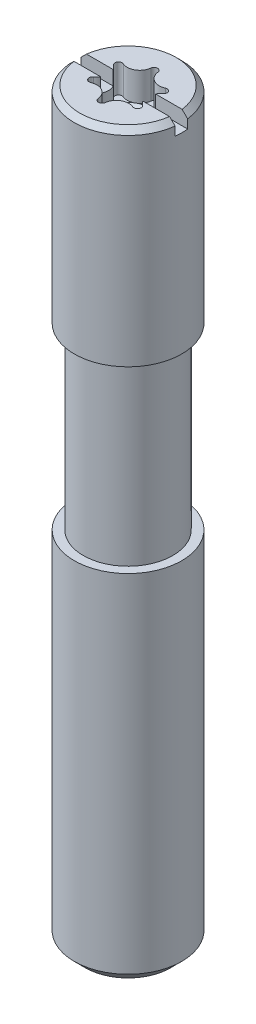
ISO-10303-21;
HEADER;
FILE_DESCRIPTION(('STEP AP214'),'2;1');
FILE_NAME('part.step','',(''),(''),'','','');
FILE_SCHEMA(('AUTOMOTIVE_DESIGN { 1 0 10303 214 1 1 1 1 }'));
ENDSEC;
DATA;
#1=APPLICATION_CONTEXT('core data for automotive mechanical design processes');
#2=APPLICATION_PROTOCOL_DEFINITION('international standard','automotive_design',2000,#1);
#3=PRODUCT_CONTEXT('',#1,'mechanical');
#4=PRODUCT('Part','Part','',(#3));
#5=PRODUCT_RELATED_PRODUCT_CATEGORY('part','',(#4));
#6=PRODUCT_DEFINITION_FORMATION('','',#4);
#7=PRODUCT_DEFINITION_CONTEXT('part definition',#1,'design');
#8=PRODUCT_DEFINITION('design','',#6,#7);
#9=PRODUCT_DEFINITION_SHAPE('','',#8);
#10=(LENGTH_UNIT() NAMED_UNIT(*) SI_UNIT(.MILLI.,.METRE.));
#11=(NAMED_UNIT(*) PLANE_ANGLE_UNIT() SI_UNIT($,.RADIAN.));
#12=(NAMED_UNIT(*) SI_UNIT($,.STERADIAN.) SOLID_ANGLE_UNIT());
#13=UNCERTAINTY_MEASURE_WITH_UNIT(LENGTH_MEASURE(1.E-05),#10,'distance_accuracy_value','');
#14=(GEOMETRIC_REPRESENTATION_CONTEXT(3) GLOBAL_UNCERTAINTY_ASSIGNED_CONTEXT((#13)) GLOBAL_UNIT_ASSIGNED_CONTEXT((#10,
#11,#12)) REPRESENTATION_CONTEXT('',''));
#15=CARTESIAN_POINT('',(0.,0.,0.));
#16=DIRECTION('',(0.,0.,1.));
#17=DIRECTION('',(1.,0.,0.));
#18=AXIS2_PLACEMENT_3D('',#15,#16,#17);
#19=CARTESIAN_POINT('',(0.,0.,0.35));
#20=DIRECTION('',(0.,0.,1.));
#21=DIRECTION('',(1.,0.,0.));
#22=AXIS2_PLACEMENT_3D('',#19,#20,#21);
#23=PLANE('',#22);
#24=DIRECTION('',(1.,0.,0.));
#25=VECTOR('',#24,1.);
#26=CARTESIAN_POINT('',(0.,41.5,0.35));
#27=LINE('',#26,#25);
#28=CARTESIAN_POINT('',(-1.18278727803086,41.5,0.35));
#29=VERTEX_POINT('',#28);
#30=CARTESIAN_POINT('',(-2.67066326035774,41.4999999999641,0.35));
#31=VERTEX_POINT('',#30);
#32=EDGE_CURVE('E206',#29,#31,#27,.F.);
#33=ORIENTED_EDGE('',*,*,#32,.F.);
#34=DIRECTION('',(0.,1.,0.));
#35=VECTOR('',#34,1.);
#36=CARTESIAN_POINT('',(-1.18278727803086,0.,0.35));
#37=LINE('',#36,#35);
#38=CARTESIAN_POINT('',(-1.18278727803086,40.7,0.35));
#39=VERTEX_POINT('',#38);
#40=EDGE_CURVE('E215',#39,#29,#37,.T.);
#41=ORIENTED_EDGE('',*,*,#40,.F.);
#42=DIRECTION('',(1.,0.,0.));
#43=VECTOR('',#42,1.);
#44=CARTESIAN_POINT('',(-4.,40.7,0.35));
#45=LINE('',#44,#43);
#46=CARTESIAN_POINT('',(-2.97951338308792,40.7,0.35));
#47=VERTEX_POINT('',#46);
#48=EDGE_CURVE('E232',#47,#39,#45,.T.);
#49=ORIENTED_EDGE('',*,*,#48,.F.);
#50=DIRECTION('',(0.,1.,0.));
#51=VECTOR('',#50,1.);
#52=CARTESIAN_POINT('',(-2.97951338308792,0.,0.35));
#53=LINE('',#52,#51);
#54=CARTESIAN_POINT('',(-2.97951338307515,41.1934999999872,0.35));
#55=VERTEX_POINT('',#54);
#56=EDGE_CURVE('E229',#55,#47,#53,.F.);
#57=ORIENTED_EDGE('',*,*,#56,.F.);
#58=CARTESIAN_POINT('',(-2.67066326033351,41.4999999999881,0.35));
#59=CARTESIAN_POINT('',(-2.72215944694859,41.4489379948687,0.35));
#60=CARTESIAN_POINT('',(-2.77364505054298,41.3978653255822,0.35));
#61=CARTESIAN_POINT('',(-2.8765950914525,41.2956986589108,0.35));
#62=CARTESIAN_POINT('',(-2.92805952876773,41.2446046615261,0.35));
#63=CARTESIAN_POINT('',(-2.97951338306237,41.1934999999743,0.35));
#64=B_SPLINE_CURVE_WITH_KNOTS('',3,(#58,#59,#60,#61,#62,#63),.UNSPECIFIED.,.F.,.F.,(4,2,4),(0.,
0.217560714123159,0.435121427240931),.UNSPECIFIED.);
#65=EDGE_CURVE('E19',#31,#55,#64,.T.);
#66=ORIENTED_EDGE('',*,*,#65,.F.);
#67=EDGE_LOOP('',(#33,#41,#49,#57,#66));
#68=FACE_BOUND('',#67,.T.);
#69=ADVANCED_FACE('F15',(#68),#23,.F.);
#70=CARTESIAN_POINT('',(-4.,40.7,0.35));
#71=DIRECTION('',(0.,1.,0.));
#72=DIRECTION('',(0.,0.,1.));
#73=AXIS2_PLACEMENT_3D('',#70,#71,#72);
#74=PLANE('',#73);
#75=CARTESIAN_POINT('',(-1.78900506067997,40.7,0.));
#76=DIRECTION('',(0.,1.,0.));
#77=DIRECTION('',(0.,0.,1.));
#78=AXIS2_PLACEMENT_3D('',#75,#76,#77);
#79=CIRCLE('',#78,0.7);
#80=CARTESIAN_POINT('',(-1.18278727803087,40.7,-0.35));
#81=VERTEX_POINT('',#80);
#82=EDGE_CURVE('E236',#39,#81,#79,.T.);
#83=ORIENTED_EDGE('',*,*,#82,.T.);
#84=DIRECTION('',(1.,0.,0.));
#85=VECTOR('',#84,1.);
#86=CARTESIAN_POINT('',(0.,40.7,-0.35));
#87=LINE('',#86,#85);
#88=CARTESIAN_POINT('',(-2.97951338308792,40.7,-0.35));
#89=VERTEX_POINT('',#88);
#90=EDGE_CURVE('E487',#89,#81,#87,.T.);
#91=ORIENTED_EDGE('',*,*,#90,.F.);
#92=CARTESIAN_POINT('',(0.,40.7,0.));
#93=DIRECTION('',(0.,-1.,0.));
#94=DIRECTION('',(0.,0.,-1.));
#95=AXIS2_PLACEMENT_3D('',#92,#93,#94);
#96=CIRCLE('',#95,3.);
#97=EDGE_CURVE('E230',#89,#47,#96,.F.);
#98=ORIENTED_EDGE('',*,*,#97,.T.);
#99=ORIENTED_EDGE('',*,*,#48,.T.);
#100=EDGE_LOOP('',(#83,#91,#98,#99));
#101=FACE_BOUND('',#100,.T.);
#102=ADVANCED_FACE('F729',(#101),#74,.T.);
#103=CARTESIAN_POINT('',(0.,0.,-0.35));
#104=DIRECTION('',(0.,0.,1.));
#105=DIRECTION('',(1.,0.,0.));
#106=AXIS2_PLACEMENT_3D('',#103,#104,#105);
#107=PLANE('',#106);
#108=DIRECTION('',(1.,0.,0.));
#109=VECTOR('',#108,1.);
#110=CARTESIAN_POINT('',(0.,41.5,-0.35));
#111=LINE('',#110,#109);
#112=CARTESIAN_POINT('',(-1.18278727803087,41.5,-0.35));
#113=VERTEX_POINT('',#112);
#114=CARTESIAN_POINT('',(-2.67066326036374,41.4999999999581,-0.35));
#115=VERTEX_POINT('',#114);
#116=EDGE_CURVE('E251',#113,#115,#111,.F.);
#117=ORIENTED_EDGE('',*,*,#116,.T.);
#118=CARTESIAN_POINT('',(-2.67066326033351,41.4999999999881,-0.35));
#119=CARTESIAN_POINT('',(-2.72215944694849,41.4489379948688,-0.35));
#120=CARTESIAN_POINT('',(-2.77364505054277,41.3978653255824,-0.35));
#121=CARTESIAN_POINT('',(-2.87659509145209,41.2956986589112,-0.35));
#122=CARTESIAN_POINT('',(-2.92805952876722,41.2446046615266,-0.35));
#123=CARTESIAN_POINT('',(-2.97951338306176,41.1934999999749,-0.35));
#124=B_SPLINE_CURVE_WITH_KNOTS('',3,(#118,#119,#120,#121,#122,#123),.UNSPECIFIED.,.F.,.F.,(4,2,
4),(0.,0.21756071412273,0.435121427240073),.UNSPECIFIED.);
#125=CARTESIAN_POINT('',(-2.97951338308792,41.1934999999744,-0.35));
#126=VERTEX_POINT('',#125);
#127=EDGE_CURVE('E241',#115,#126,#124,.T.);
#128=ORIENTED_EDGE('',*,*,#127,.T.);
#129=DIRECTION('',(0.,1.,0.));
#130=VECTOR('',#129,1.);
#131=CARTESIAN_POINT('',(-2.97951338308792,0.,-0.35));
#132=LINE('',#131,#130);
#133=EDGE_CURVE('E240',#126,#89,#132,.F.);
#134=ORIENTED_EDGE('',*,*,#133,.T.);
#135=ORIENTED_EDGE('',*,*,#90,.T.);
#136=DIRECTION('',(0.,1.,0.));
#137=VECTOR('',#136,1.);
#138=CARTESIAN_POINT('',(-1.18278727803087,39.9,-0.35));
#139=LINE('',#138,#137);
#140=EDGE_CURVE('E462',#113,#81,#139,.F.);
#141=ORIENTED_EDGE('',*,*,#140,.F.);
#142=EDGE_LOOP('',(#117,#128,#134,#135,#141));
#143=FACE_BOUND('',#142,.T.);
#144=ADVANCED_FACE('F253',(#143),#107,.T.);
#145=CARTESIAN_POINT('',(1.78900506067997,39.9,0.));
#146=DIRECTION('',(0.,1.,0.));
#147=DIRECTION('',(0.,0.,1.));
#148=AXIS2_PLACEMENT_3D('',#145,#146,#147);
#149=CYLINDRICAL_SURFACE('',#148,0.7);
#150=DIRECTION('',(0.,1.,0.));
#151=VECTOR('',#150,1.);
#152=CARTESIAN_POINT('',(1.3742408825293,39.9,0.563888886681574));
#153=LINE('',#152,#151);
#154=CARTESIAN_POINT('',(1.37424088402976,39.9,0.563888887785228));
#155=VERTEX_POINT('',#154);
#156=CARTESIAN_POINT('',(1.37424088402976,41.5,0.563888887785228));
#157=VERTEX_POINT('',#156);
#158=EDGE_CURVE('E472',#155,#157,#153,.T.);
#159=ORIENTED_EDGE('',*,*,#158,.T.);
#160=CARTESIAN_POINT('',(1.78900506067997,41.5,0.));
#161=DIRECTION('',(0.,1.,0.));
#162=DIRECTION('',(0.,0.,1.));
#163=AXIS2_PLACEMENT_3D('',#160,#161,#162);
#164=CIRCLE('',#163,0.7);
#165=CARTESIAN_POINT('',(1.18278727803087,41.5,0.35));
#166=VERTEX_POINT('',#165);
#167=EDGE_CURVE('E609',#157,#166,#164,.F.);
#168=ORIENTED_EDGE('',*,*,#167,.T.);
#169=DIRECTION('',(0.,1.,0.));
#170=VECTOR('',#169,1.);
#171=CARTESIAN_POINT('',(1.18278727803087,0.,0.35));
#172=LINE('',#171,#170);
#173=CARTESIAN_POINT('',(1.18278727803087,40.7,0.35));
#174=VERTEX_POINT('',#173);
#175=EDGE_CURVE('E455',#166,#174,#172,.F.);
#176=ORIENTED_EDGE('',*,*,#175,.T.);
#177=CARTESIAN_POINT('',(1.78900506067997,40.7,0.));
#178=DIRECTION('',(0.,1.,0.));
#179=DIRECTION('',(0.,0.,1.));
#180=AXIS2_PLACEMENT_3D('',#177,#178,#179);
#181=CIRCLE('',#180,0.7);
#182=CARTESIAN_POINT('',(1.18278727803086,40.7,-0.35));
#183=VERTEX_POINT('',#182);
#184=EDGE_CURVE('E250',#174,#183,#181,.F.);
#185=ORIENTED_EDGE('',*,*,#184,.T.);
#186=DIRECTION('',(0.,1.,0.));
#187=VECTOR('',#186,1.);
#188=CARTESIAN_POINT('',(1.18278727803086,39.9,-0.35));
#189=LINE('',#188,#187);
#190=CARTESIAN_POINT('',(1.18278727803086,41.5,-0.35));
#191=VERTEX_POINT('',#190);
#192=EDGE_CURVE('E488',#183,#191,#189,.T.);
#193=ORIENTED_EDGE('',*,*,#192,.T.);
#194=CARTESIAN_POINT('',(1.78900506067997,41.5,0.));
#195=DIRECTION('',(0.,1.,0.));
#196=DIRECTION('',(0.,0.,1.));
#197=AXIS2_PLACEMENT_3D('',#194,#195,#196);
#198=CIRCLE('',#197,0.7);
#199=CARTESIAN_POINT('',(1.37424088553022,41.5,-0.563888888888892));
#200=VERTEX_POINT('',#199);
#201=EDGE_CURVE('E491',#191,#200,#198,.F.);
#202=ORIENTED_EDGE('',*,*,#201,.T.);
#203=DIRECTION('',(0.,1.,0.));
#204=VECTOR('',#203,1.);
#205=CARTESIAN_POINT('',(1.37424088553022,39.9,-0.563888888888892));
#206=LINE('',#205,#204);
#207=CARTESIAN_POINT('',(1.37424088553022,39.9,-0.563888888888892));
#208=VERTEX_POINT('',#207);
#209=EDGE_CURVE('E468',#200,#208,#206,.F.);
#210=ORIENTED_EDGE('',*,*,#209,.T.);
#211=CARTESIAN_POINT('',(1.78900506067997,39.9,0.));
#212=DIRECTION('',(0.,1.,0.));
#213=DIRECTION('',(0.,0.,1.));
#214=AXIS2_PLACEMENT_3D('',#211,#212,#213);
#215=CIRCLE('',#214,0.7);
#216=CARTESIAN_POINT('',(1.09573169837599,39.8999999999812,-0.0968093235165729));
#217=VERTEX_POINT('',#216);
#218=EDGE_CURVE('E471',#217,#208,#215,.F.);
#219=ORIENTED_EDGE('',*,*,#218,.F.);
#220=CARTESIAN_POINT('',(1.09573169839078,39.8999999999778,-0.0968093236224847));
#221=CARTESIAN_POINT('',(1.09124727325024,39.8973321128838,-0.0645395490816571));
#222=CARTESIAN_POINT('',(1.08900506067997,39.8959981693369,-0.0322697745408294));
#223=CARTESIAN_POINT('',(1.08900506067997,39.8959981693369,0.0322697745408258));
#224=CARTESIAN_POINT('',(1.09124727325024,39.8973321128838,0.0645395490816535));
#225=CARTESIAN_POINT('',(1.09573169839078,39.8999999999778,0.0968093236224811));
#226=B_SPLINE_CURVE_WITH_KNOTS('',3,(#220,#221,#222,#223,#224,#225),.UNSPECIFIED.,.F.,.F.,(4,2,
4),(0.,0.0971252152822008,0.194250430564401),.UNSPECIFIED.);
#227=CARTESIAN_POINT('',(1.09573169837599,39.8999999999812,0.0968093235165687));
#228=VERTEX_POINT('',#227);
#229=EDGE_CURVE('E603',#217,#228,#226,.T.);
#230=ORIENTED_EDGE('',*,*,#229,.T.);
#231=CARTESIAN_POINT('',(1.78900506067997,39.9,0.));
#232=DIRECTION('',(0.,1.,0.));
#233=DIRECTION('',(0.,0.,1.));
#234=AXIS2_PLACEMENT_3D('',#231,#232,#233);
#235=CIRCLE('',#234,0.7);
#236=EDGE_CURVE('E574',#155,#228,#235,.F.);
#237=ORIENTED_EDGE('',*,*,#236,.F.);
#238=EDGE_LOOP('',(#159,#168,#176,#185,#193,#202,#210,#219,#230,#237));
#239=FACE_BOUND('',#238,.T.);
#240=ADVANCED_FACE('F598',(#239),#149,.T.);
#241=CARTESIAN_POINT('',(-1.78900506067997,39.9,0.));
#242=DIRECTION('',(0.,1.,0.));
#243=DIRECTION('',(0.,0.,1.));
#244=AXIS2_PLACEMENT_3D('',#241,#242,#243);
#245=CYLINDRICAL_SURFACE('',#244,0.7);
#246=ORIENTED_EDGE('',*,*,#140,.T.);
#247=ORIENTED_EDGE('',*,*,#82,.F.);
#248=ORIENTED_EDGE('',*,*,#40,.T.);
#249=CARTESIAN_POINT('',(-1.78900506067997,41.5,0.));
#250=DIRECTION('',(0.,1.,0.));
#251=DIRECTION('',(0.,0.,1.));
#252=AXIS2_PLACEMENT_3D('',#249,#250,#251);
#253=CIRCLE('',#252,0.7);
#254=CARTESIAN_POINT('',(-1.37424089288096,41.5,0.563888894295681));
#255=VERTEX_POINT('',#254);
#256=EDGE_CURVE('E212',#29,#255,#253,.F.);
#257=ORIENTED_EDGE('',*,*,#256,.T.);
#258=DIRECTION('',(0.,1.,0.));
#259=VECTOR('',#258,1.);
#260=CARTESIAN_POINT('',(-1.3742409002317,39.9,0.563888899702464));
#261=LINE('',#260,#259);
#262=CARTESIAN_POINT('',(-1.37424089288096,39.9,0.563888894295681));
#263=VERTEX_POINT('',#262);
#264=EDGE_CURVE('E477',#255,#263,#261,.F.);
#265=ORIENTED_EDGE('',*,*,#264,.T.);
#266=CARTESIAN_POINT('',(-1.78900506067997,39.9,0.));
#267=DIRECTION('',(0.,1.,0.));
#268=DIRECTION('',(0.,0.,1.));
#269=AXIS2_PLACEMENT_3D('',#266,#267,#268);
#270=CIRCLE('',#269,0.7);
#271=CARTESIAN_POINT('',(-1.09573169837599,39.8999999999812,0.0968093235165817));
#272=VERTEX_POINT('',#271);
#273=EDGE_CURVE('E458',#272,#263,#270,.F.);
#274=ORIENTED_EDGE('',*,*,#273,.F.);
#275=CARTESIAN_POINT('',(-1.09573169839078,39.8999999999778,0.0968093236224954));
#276=CARTESIAN_POINT('',(-1.09124727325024,39.8973321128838,0.0645395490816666));
#277=CARTESIAN_POINT('',(-1.08900506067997,39.8959981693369,0.0322697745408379));
#278=CARTESIAN_POINT('',(-1.08900506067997,39.8959981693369,-0.0322697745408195));
#279=CARTESIAN_POINT('',(-1.09124727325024,39.8973321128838,-0.0645395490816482));
#280=CARTESIAN_POINT('',(-1.09573169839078,39.8999999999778,-0.0968093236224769));
#281=B_SPLINE_CURVE_WITH_KNOTS('',3,(#275,#276,#277,#278,#279,#280),.UNSPECIFIED.,.F.,.F.,(4,2,
4),(0.,0.097125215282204,0.194250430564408),.UNSPECIFIED.);
#282=CARTESIAN_POINT('',(-1.09573169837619,39.8999999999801,-0.0968093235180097));
#283=VERTEX_POINT('',#282);
#284=EDGE_CURVE('E316',#272,#283,#281,.T.);
#285=ORIENTED_EDGE('',*,*,#284,.T.);
#286=CARTESIAN_POINT('',(-1.78900506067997,39.9,0.));
#287=DIRECTION('',(0.,1.,0.));
#288=DIRECTION('',(0.,0.,1.));
#289=AXIS2_PLACEMENT_3D('',#286,#287,#288);
#290=CIRCLE('',#289,0.7);
#291=CARTESIAN_POINT('',(-1.37424088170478,39.9,-0.563888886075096));
#292=VERTEX_POINT('',#291);
#293=EDGE_CURVE('E653',#283,#292,#290,.T.);
#294=ORIENTED_EDGE('',*,*,#293,.T.);
#295=DIRECTION('',(0.,1.,0.));
#296=VECTOR('',#295,1.);
#297=CARTESIAN_POINT('',(-1.37424087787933,39.9,-0.563888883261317));
#298=LINE('',#297,#296);
#299=CARTESIAN_POINT('',(-1.37424088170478,41.5,-0.563888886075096));
#300=VERTEX_POINT('',#299);
#301=EDGE_CURVE('E463',#292,#300,#298,.T.);
#302=ORIENTED_EDGE('',*,*,#301,.T.);
#303=CARTESIAN_POINT('',(-1.78900506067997,41.5,0.));
#304=DIRECTION('',(0.,1.,0.));
#305=DIRECTION('',(0.,0.,1.));
#306=AXIS2_PLACEMENT_3D('',#303,#304,#305);
#307=CIRCLE('',#306,0.7);
#308=EDGE_CURVE('E484',#300,#113,#307,.F.);
#309=ORIENTED_EDGE('',*,*,#308,.T.);
#310=EDGE_LOOP('',(#246,#247,#248,#257,#265,#274,#285,#294,#302,#309));
#311=FACE_BOUND('',#310,.T.);
#312=ADVANCED_FACE('F593',(#311),#245,.T.);
#313=CARTESIAN_POINT('',(0.,0.,0.35));
#314=DIRECTION('',(0.,0.,1.));
#315=DIRECTION('',(1.,0.,0.));
#316=AXIS2_PLACEMENT_3D('',#313,#314,#315);
#317=PLANE('',#316);
#318=ORIENTED_EDGE('',*,*,#175,.F.);
#319=DIRECTION('',(1.,0.,0.));
#320=VECTOR('',#319,1.);
#321=CARTESIAN_POINT('',(0.,41.5,0.35));
#322=LINE('',#321,#320);
#323=CARTESIAN_POINT('',(2.67066326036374,41.4999999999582,0.35));
#324=VERTEX_POINT('',#323);
#325=EDGE_CURVE('E459',#324,#166,#322,.F.);
#326=ORIENTED_EDGE('',*,*,#325,.F.);
#327=CARTESIAN_POINT('',(2.97951338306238,41.1934999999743,0.35));
#328=CARTESIAN_POINT('',(2.92805952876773,41.2446046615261,0.35));
#329=CARTESIAN_POINT('',(2.8765950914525,41.2956986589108,0.35));
#330=CARTESIAN_POINT('',(2.77364505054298,41.3978653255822,0.35));
#331=CARTESIAN_POINT('',(2.72215944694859,41.4489379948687,0.35));
#332=CARTESIAN_POINT('',(2.67066326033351,41.4999999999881,0.35));
#333=B_SPLINE_CURVE_WITH_KNOTS('',3,(#327,#328,#329,#330,#331,#332),.UNSPECIFIED.,.F.,.F.,(4,2,
4),(0.,0.217560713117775,0.435121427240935),.UNSPECIFIED.);
#334=CARTESIAN_POINT('',(2.97951338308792,41.1934999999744,0.35));
#335=VERTEX_POINT('',#334);
#336=EDGE_CURVE('E223',#335,#324,#333,.T.);
#337=ORIENTED_EDGE('',*,*,#336,.F.);
#338=DIRECTION('',(0.,1.,0.));
#339=VECTOR('',#338,1.);
#340=CARTESIAN_POINT('',(2.97951338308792,0.,0.35));
#341=LINE('',#340,#339);
#342=CARTESIAN_POINT('',(2.97951338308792,40.7,0.35));
#343=VERTEX_POINT('',#342);
#344=EDGE_CURVE('E460',#343,#335,#341,.T.);
#345=ORIENTED_EDGE('',*,*,#344,.F.);
#346=DIRECTION('',(1.,0.,0.));
#347=VECTOR('',#346,1.);
#348=CARTESIAN_POINT('',(-4.,40.7,0.35));
#349=LINE('',#348,#347);
#350=EDGE_CURVE('E449',#174,#343,#349,.T.);
#351=ORIENTED_EDGE('',*,*,#350,.F.);
#352=EDGE_LOOP('',(#318,#326,#337,#345,#351));
#353=FACE_BOUND('',#352,.T.);
#354=ADVANCED_FACE('F588',(#353),#317,.F.);
#355=CARTESIAN_POINT('',(-1.52237094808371,39.9,-0.362499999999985));
#356=DIRECTION('',(0.,1.,0.));
#357=DIRECTION('',(0.,0.,1.));
#358=AXIS2_PLACEMENT_3D('',#355,#356,#357);
#359=PLANE('',#358);
#360=ORIENTED_EDGE('',*,*,#273,.T.);
#361=CARTESIAN_POINT('',(-1.25573683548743,39.9,0.725000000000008));
#362=DIRECTION('',(0.,1.,0.));
#363=DIRECTION('',(0.,0.,1.));
#364=AXIS2_PLACEMENT_3D('',#361,#362,#363);
#365=CIRCLE('',#364,0.2);
#366=CARTESIAN_POINT('',(-1.17546254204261,39.9,0.90818307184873));
#367=VERTEX_POINT('',#366);
#368=EDGE_CURVE('E479',#263,#367,#365,.T.);
#369=ORIENTED_EDGE('',*,*,#368,.T.);
#370=CARTESIAN_POINT('',(-0.894502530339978,39.9,1.54932383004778));
#371=DIRECTION('',(0.,1.,0.));
#372=DIRECTION('',(0.,0.,1.));
#373=AXIS2_PLACEMENT_3D('',#370,#371,#372);
#374=CIRCLE('',#373,0.7);
#375=CARTESIAN_POINT('',(-0.631705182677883,39.8999999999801,0.900526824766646));
#376=VERTEX_POINT('',#375);
#377=EDGE_CURVE('E353',#376,#367,#374,.T.);
#378=ORIENTED_EDGE('',*,*,#377,.F.);
#379=CARTESIAN_POINT('',(0.,39.8999999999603,0.));
#380=DIRECTION('',(0.,1.,0.));
#381=DIRECTION('',(0.,0.,1.));
#382=AXIS2_PLACEMENT_3D('',#379,#380,#381);
#383=CIRCLE('',#382,1.09999999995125);
#384=EDGE_CURVE('E551',#376,#272,#383,.F.);
#385=ORIENTED_EDGE('',*,*,#384,.T.);
#386=EDGE_LOOP('',(#360,#369,#378,#385));
#387=FACE_BOUND('',#386,.T.);
#388=ADVANCED_FACE('F592',(#387),#359,.T.);
#389=CARTESIAN_POINT('',(-1.25573683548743,39.9,0.725000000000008));
#390=DIRECTION('',(0.,1.,0.));
#391=DIRECTION('',(0.,0.,1.));
#392=AXIS2_PLACEMENT_3D('',#389,#390,#391);
#393=CYLINDRICAL_SURFACE('',#392,0.2);
#394=DIRECTION('',(0.,1.,0.));
#395=VECTOR('',#394,1.);
#396=CARTESIAN_POINT('',(-1.17546253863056,39.9,0.908183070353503));
#397=LINE('',#396,#395);
#398=CARTESIAN_POINT('',(-1.17546254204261,41.5,0.90818307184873));
#399=VERTEX_POINT('',#398);
#400=EDGE_CURVE('E531',#367,#399,#397,.T.);
#401=ORIENTED_EDGE('',*,*,#400,.F.);
#402=ORIENTED_EDGE('',*,*,#368,.F.);
#403=ORIENTED_EDGE('',*,*,#264,.F.);
#404=CARTESIAN_POINT('',(-1.25573683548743,41.5,0.725000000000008));
#405=DIRECTION('',(0.,1.,0.));
#406=DIRECTION('',(0.,0.,1.));
#407=AXIS2_PLACEMENT_3D('',#404,#405,#406);
#408=CIRCLE('',#407,0.2);
#409=EDGE_CURVE('E476',#399,#255,#408,.F.);
#410=ORIENTED_EDGE('',*,*,#409,.F.);
#411=EDGE_LOOP('',(#401,#402,#403,#410));
#412=FACE_BOUND('',#411,.T.);
#413=ADVANCED_FACE('F660',(#412),#393,.F.);
#414=CARTESIAN_POINT('',(1.25573683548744,39.9,0.725));
#415=DIRECTION('',(0.,1.,0.));
#416=DIRECTION('',(0.,0.,1.));
#417=AXIS2_PLACEMENT_3D('',#414,#415,#416);
#418=CYLINDRICAL_SURFACE('',#417,0.2);
#419=ORIENTED_EDGE('',*,*,#158,.F.);
#420=CARTESIAN_POINT('',(1.25573683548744,39.9,0.725));
#421=DIRECTION('',(0.,1.,0.));
#422=DIRECTION('',(0.,0.,1.));
#423=AXIS2_PLACEMENT_3D('',#420,#421,#422);
#424=CIRCLE('',#423,0.2);
#425=CARTESIAN_POINT('',(1.17546253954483,39.9,0.908183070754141));
#426=VERTEX_POINT('',#425);
#427=EDGE_CURVE('E571',#426,#155,#424,.T.);
#428=ORIENTED_EDGE('',*,*,#427,.F.);
#429=DIRECTION('',(0.,1.,0.));
#430=VECTOR('',#429,1.);
#431=CARTESIAN_POINT('',(1.17546253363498,39.9,0.908183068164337));
#432=LINE('',#431,#430);
#433=CARTESIAN_POINT('',(1.17546253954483,41.5,0.908183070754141));
#434=VERTEX_POINT('',#433);
#435=EDGE_CURVE('E528',#434,#426,#432,.F.);
#436=ORIENTED_EDGE('',*,*,#435,.F.);
#437=CARTESIAN_POINT('',(1.25573683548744,41.5,0.725));
#438=DIRECTION('',(0.,1.,0.));
#439=DIRECTION('',(0.,0.,1.));
#440=AXIS2_PLACEMENT_3D('',#437,#438,#439);
#441=CIRCLE('',#440,0.2);
#442=EDGE_CURVE('E475',#157,#434,#441,.F.);
#443=ORIENTED_EDGE('',*,*,#442,.F.);
#444=EDGE_LOOP('',(#419,#428,#436,#443));
#445=FACE_BOUND('',#444,.T.);
#446=ADVANCED_FACE('F641',(#445),#418,.F.);
#447=CARTESIAN_POINT('',(-1.52237094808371,39.9,-0.362499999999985));
#448=DIRECTION('',(0.,1.,0.));
#449=DIRECTION('',(0.,0.,1.));
#450=AXIS2_PLACEMENT_3D('',#447,#448,#449);
#451=PLANE('',#450);
#452=CARTESIAN_POINT('',(0.894502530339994,39.9,1.54932383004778));
#453=DIRECTION('',(0.,1.,0.));
#454=DIRECTION('',(0.,0.,1.));
#455=AXIS2_PLACEMENT_3D('',#452,#453,#454);
#456=CIRCLE('',#455,0.7);
#457=CARTESIAN_POINT('',(0.631705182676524,39.899999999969,0.900526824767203));
#458=VERTEX_POINT('',#457);
#459=EDGE_CURVE('E530',#426,#458,#456,.T.);
#460=ORIENTED_EDGE('',*,*,#459,.F.);
#461=ORIENTED_EDGE('',*,*,#427,.T.);
#462=ORIENTED_EDGE('',*,*,#236,.T.);
#463=CARTESIAN_POINT('',(0.,39.8999999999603,0.));
#464=DIRECTION('',(0.,1.,0.));
#465=DIRECTION('',(0.,0.,1.));
#466=AXIS2_PLACEMENT_3D('',#463,#464,#465);
#467=CIRCLE('',#466,1.09999999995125);
#468=EDGE_CURVE('E556',#228,#458,#467,.F.);
#469=ORIENTED_EDGE('',*,*,#468,.T.);
#470=EDGE_LOOP('',(#460,#461,#462,#469));
#471=FACE_BOUND('',#470,.T.);
#472=ADVANCED_FACE('F631',(#471),#451,.T.);
#473=CARTESIAN_POINT('',(-1.52237094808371,39.9,-0.362499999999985));
#474=DIRECTION('',(0.,1.,0.));
#475=DIRECTION('',(0.,0.,1.));
#476=AXIS2_PLACEMENT_3D('',#473,#474,#475);
#477=PLANE('',#476);
#478=CARTESIAN_POINT('',(-0.894502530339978,39.9,1.54932383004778));
#479=DIRECTION('',(0.,1.,0.));
#480=DIRECTION('',(0.,0.,1.));
#481=AXIS2_PLACEMENT_3D('',#478,#479,#480);
#482=CIRCLE('',#481,0.7);
#483=CARTESIAN_POINT('',(-0.198778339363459,39.9,1.47207196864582));
#484=VERTEX_POINT('',#483);
#485=CARTESIAN_POINT('',(-0.464026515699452,39.899999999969,0.997336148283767));
#486=VERTEX_POINT('',#485);
#487=EDGE_CURVE('E354',#484,#486,#482,.T.);
#488=ORIENTED_EDGE('',*,*,#487,.F.);
#489=CARTESIAN_POINT('',(0.,39.9,1.45));
#490=DIRECTION('',(0.,1.,0.));
#491=DIRECTION('',(0.,0.,1.));
#492=AXIS2_PLACEMENT_3D('',#489,#490,#491);
#493=CIRCLE('',#492,0.2);
#494=CARTESIAN_POINT('',(0.198778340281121,39.9,1.47207196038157));
#495=VERTEX_POINT('',#494);
#496=EDGE_CURVE('E569',#484,#495,#493,.T.);
#497=ORIENTED_EDGE('',*,*,#496,.T.);
#498=CARTESIAN_POINT('',(0.894502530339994,39.9,1.54932383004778));
#499=DIRECTION('',(0.,1.,0.));
#500=DIRECTION('',(0.,0.,1.));
#501=AXIS2_PLACEMENT_3D('',#498,#499,#500);
#502=CIRCLE('',#501,0.7);
#503=CARTESIAN_POINT('',(0.464026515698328,39.8999999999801,0.997336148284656));
#504=VERTEX_POINT('',#503);
#505=EDGE_CURVE('E527',#504,#495,#502,.T.);
#506=ORIENTED_EDGE('',*,*,#505,.F.);
#507=CARTESIAN_POINT('',(0.,39.8999999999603,0.));
#508=DIRECTION('',(0.,1.,0.));
#509=DIRECTION('',(0.,0.,1.));
#510=AXIS2_PLACEMENT_3D('',#507,#508,#509);
#511=CIRCLE('',#510,1.09999999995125);
#512=EDGE_CURVE('E554',#504,#486,#511,.F.);
#513=ORIENTED_EDGE('',*,*,#512,.T.);
#514=EDGE_LOOP('',(#488,#497,#506,#513));
#515=FACE_BOUND('',#514,.T.);
#516=ADVANCED_FACE('F683',(#515),#477,.T.);
#517=CARTESIAN_POINT('',(0.,39.9,1.45));
#518=DIRECTION('',(0.,1.,0.));
#519=DIRECTION('',(0.,0.,1.));
#520=AXIS2_PLACEMENT_3D('',#517,#518,#519);
#521=CYLINDRICAL_SURFACE('',#520,0.2);
#522=DIRECTION('',(0.,1.,0.));
#523=VECTOR('',#522,1.);
#524=CARTESIAN_POINT('',(0.198778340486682,39.9,1.4720719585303));
#525=LINE('',#524,#523);
#526=CARTESIAN_POINT('',(0.198778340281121,41.5,1.47207196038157));
#527=VERTEX_POINT('',#526);
#528=EDGE_CURVE('E525',#495,#527,#525,.T.);
#529=ORIENTED_EDGE('',*,*,#528,.F.);
#530=ORIENTED_EDGE('',*,*,#496,.F.);
#531=DIRECTION('',(0.,1.,0.));
#532=VECTOR('',#531,1.);
#533=CARTESIAN_POINT('',(-0.198778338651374,39.9,1.4720719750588));
#534=LINE('',#533,#532);
#535=CARTESIAN_POINT('',(-0.198778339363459,41.5,1.47207196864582));
#536=VERTEX_POINT('',#535);
#537=EDGE_CURVE('E532',#536,#484,#534,.F.);
#538=ORIENTED_EDGE('',*,*,#537,.F.);
#539=CARTESIAN_POINT('',(0.,41.5,1.45));
#540=DIRECTION('',(0.,1.,0.));
#541=DIRECTION('',(0.,0.,1.));
#542=AXIS2_PLACEMENT_3D('',#539,#540,#541);
#543=CIRCLE('',#542,0.2);
#544=EDGE_CURVE('E567',#527,#536,#543,.F.);
#545=ORIENTED_EDGE('',*,*,#544,.F.);
#546=EDGE_LOOP('',(#529,#530,#538,#545));
#547=FACE_BOUND('',#546,.T.);
#548=ADVANCED_FACE('F685',(#547),#521,.F.);
#549=CARTESIAN_POINT('',(-1.52237094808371,39.9,-0.362499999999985));
#550=DIRECTION('',(0.,1.,0.));
#551=DIRECTION('',(0.,0.,1.));
#552=AXIS2_PLACEMENT_3D('',#549,#550,#551);
#553=PLANE('',#552);
#554=ORIENTED_EDGE('',*,*,#218,.T.);
#555=CARTESIAN_POINT('',(1.25573683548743,39.9,-0.725));
#556=DIRECTION('',(0.,1.,0.));
#557=DIRECTION('',(0.,0.,1.));
#558=AXIS2_PLACEMENT_3D('',#555,#556,#557);
#559=CIRCLE('',#558,0.2);
#560=CARTESIAN_POINT('',(1.17546254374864,39.9,-0.908183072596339));
#561=VERTEX_POINT('',#560);
#562=EDGE_CURVE('E470',#208,#561,#559,.T.);
#563=ORIENTED_EDGE('',*,*,#562,.T.);
#564=CARTESIAN_POINT('',(0.894502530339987,39.9,-1.54932383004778));
#565=DIRECTION('',(0.,1.,0.));
#566=DIRECTION('',(0.,0.,1.));
#567=AXIS2_PLACEMENT_3D('',#564,#565,#566);
#568=CIRCLE('',#567,0.7);
#569=CARTESIAN_POINT('',(0.631705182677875,39.8999999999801,-0.900526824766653));
#570=VERTEX_POINT('',#569);
#571=EDGE_CURVE('E520',#570,#561,#568,.T.);
#572=ORIENTED_EDGE('',*,*,#571,.F.);
#573=CARTESIAN_POINT('',(0.,39.8999999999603,0.));
#574=DIRECTION('',(0.,1.,0.));
#575=DIRECTION('',(0.,0.,1.));
#576=AXIS2_PLACEMENT_3D('',#573,#574,#575);
#577=CIRCLE('',#576,1.09999999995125);
#578=EDGE_CURVE('E546',#570,#217,#577,.F.);
#579=ORIENTED_EDGE('',*,*,#578,.T.);
#580=EDGE_LOOP('',(#554,#563,#572,#579));
#581=FACE_BOUND('',#580,.T.);
#582=ADVANCED_FACE('F624',(#581),#553,.T.);
#583=CARTESIAN_POINT('',(1.25573683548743,39.9,-0.725));
#584=DIRECTION('',(0.,1.,0.));
#585=DIRECTION('',(0.,0.,1.));
#586=AXIS2_PLACEMENT_3D('',#583,#584,#585);
#587=CYLINDRICAL_SURFACE('',#586,0.2);
#588=DIRECTION('',(0.,1.,0.));
#589=VECTOR('',#588,1.);
#590=CARTESIAN_POINT('',(1.17546254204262,39.9,-0.908183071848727));
#591=LINE('',#590,#589);
#592=CARTESIAN_POINT('',(1.17546254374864,41.5,-0.908183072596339));
#593=VERTEX_POINT('',#592);
#594=EDGE_CURVE('E517',#561,#593,#591,.T.);
#595=ORIENTED_EDGE('',*,*,#594,.F.);
#596=ORIENTED_EDGE('',*,*,#562,.F.);
#597=ORIENTED_EDGE('',*,*,#209,.F.);
#598=CARTESIAN_POINT('',(1.25573683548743,41.5,-0.725));
#599=DIRECTION('',(0.,1.,0.));
#600=DIRECTION('',(0.,0.,1.));
#601=AXIS2_PLACEMENT_3D('',#598,#599,#600);
#602=CIRCLE('',#601,0.2);
#603=EDGE_CURVE('E467',#593,#200,#602,.F.);
#604=ORIENTED_EDGE('',*,*,#603,.F.);
#605=EDGE_LOOP('',(#595,#596,#597,#604));
#606=FACE_BOUND('',#605,.T.);
#607=ADVANCED_FACE('F620',(#606),#587,.F.);
#608=CARTESIAN_POINT('',(-1.25573683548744,39.9,-0.724999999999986));
#609=DIRECTION('',(0.,1.,0.));
#610=DIRECTION('',(0.,0.,1.));
#611=AXIS2_PLACEMENT_3D('',#608,#609,#610);
#612=CYLINDRICAL_SURFACE('',#611,0.2);
#613=ORIENTED_EDGE('',*,*,#301,.F.);
#614=CARTESIAN_POINT('',(-1.25573683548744,39.9,-0.724999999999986));
#615=DIRECTION('',(0.,1.,0.));
#616=DIRECTION('',(0.,0.,1.));
#617=AXIS2_PLACEMENT_3D('',#614,#615,#616);
#618=CIRCLE('',#617,0.2);
#619=CARTESIAN_POINT('',(-1.17546253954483,39.9,-0.908183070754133));
#620=VERTEX_POINT('',#619);
#621=EDGE_CURVE('E558',#620,#292,#618,.T.);
#622=ORIENTED_EDGE('',*,*,#621,.F.);
#623=DIRECTION('',(0.,1.,0.));
#624=VECTOR('',#623,1.);
#625=CARTESIAN_POINT('',(-1.17546253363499,39.9,-0.908183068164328));
#626=LINE('',#625,#624);
#627=CARTESIAN_POINT('',(-1.17546253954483,41.5,-0.908183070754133));
#628=VERTEX_POINT('',#627);
#629=EDGE_CURVE('E514',#628,#620,#626,.F.);
#630=ORIENTED_EDGE('',*,*,#629,.F.);
#631=CARTESIAN_POINT('',(-1.25573683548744,41.5,-0.724999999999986));
#632=DIRECTION('',(0.,1.,0.));
#633=DIRECTION('',(0.,0.,1.));
#634=AXIS2_PLACEMENT_3D('',#631,#632,#633);
#635=CIRCLE('',#634,0.2);
#636=EDGE_CURVE('E466',#300,#628,#635,.F.);
#637=ORIENTED_EDGE('',*,*,#636,.F.);
#638=EDGE_LOOP('',(#613,#622,#630,#637));
#639=FACE_BOUND('',#638,.T.);
#640=ADVANCED_FACE('F671',(#639),#612,.F.);
#641=CARTESIAN_POINT('',(-1.52237094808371,39.9,-0.362499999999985));
#642=DIRECTION('',(0.,1.,0.));
#643=DIRECTION('',(0.,0.,1.));
#644=AXIS2_PLACEMENT_3D('',#641,#642,#643);
#645=PLANE('',#644);
#646=CARTESIAN_POINT('',(-0.894502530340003,39.9,-1.54932383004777));
#647=DIRECTION('',(0.,1.,0.));
#648=DIRECTION('',(0.,0.,1.));
#649=AXIS2_PLACEMENT_3D('',#646,#647,#648);
#650=CIRCLE('',#649,0.7);
#651=CARTESIAN_POINT('',(-0.631705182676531,39.899999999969,-0.900526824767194));
#652=VERTEX_POINT('',#651);
#653=EDGE_CURVE('E301',#620,#652,#650,.T.);
#654=ORIENTED_EDGE('',*,*,#653,.F.);
#655=ORIENTED_EDGE('',*,*,#621,.T.);
#656=ORIENTED_EDGE('',*,*,#293,.F.);
#657=CARTESIAN_POINT('',(0.,39.8999999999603,0.));
#658=DIRECTION('',(0.,1.,0.));
#659=DIRECTION('',(0.,0.,1.));
#660=AXIS2_PLACEMENT_3D('',#657,#658,#659);
#661=CIRCLE('',#660,1.09999999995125);
#662=EDGE_CURVE('E549',#283,#652,#661,.F.);
#663=ORIENTED_EDGE('',*,*,#662,.T.);
#664=EDGE_LOOP('',(#654,#655,#656,#663));
#665=FACE_BOUND('',#664,.T.);
#666=ADVANCED_FACE('F309',(#665),#645,.T.);
#667=CARTESIAN_POINT('',(0.,39.8999999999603,0.));
#668=DIRECTION('',(0.,1.,0.));
#669=DIRECTION('',(0.,0.,1.));
#670=AXIS2_PLACEMENT_3D('',#667,#668,#669);
#671=CONICAL_SURFACE('',#670,1.09999999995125,1.22173047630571);
#672=CARTESIAN_POINT('',(1.13686837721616E-10,39.4996327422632,0.));
#673=VERTEX_POINT('',#672);
#674=VERTEX_LOOP('',#673);
#675=FACE_BOUND('',#674,.T.);
#676=ORIENTED_EDGE('',*,*,#578,.F.);
#677=CARTESIAN_POINT('',(0.46402651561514,39.8999999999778,-0.997336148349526));
#678=CARTESIAN_POINT('',(0.489730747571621,39.8973321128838,-0.977317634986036));
#679=CARTESIAN_POINT('',(0.516556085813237,39.8959981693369,-0.959240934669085));
#680=CARTESIAN_POINT('',(0.572448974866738,39.8959981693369,-0.92697116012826));
#681=CARTESIAN_POINT('',(0.601516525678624,39.8973321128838,-0.912778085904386));
#682=CARTESIAN_POINT('',(0.631705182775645,39.8999999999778,-0.900526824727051));
#683=B_SPLINE_CURVE_WITH_KNOTS('',3,(#677,#678,#679,#680,#681,#682),.UNSPECIFIED.,.F.,.F.,(4,2,
4),(0.,0.097125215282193,0.194250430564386),.UNSPECIFIED.);
#684=CARTESIAN_POINT('',(0.464026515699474,39.899999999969,-0.997336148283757));
#685=VERTEX_POINT('',#684);
#686=EDGE_CURVE('E329',#685,#570,#683,.T.);
#687=ORIENTED_EDGE('',*,*,#686,.F.);
#688=CARTESIAN_POINT('',(0.,39.8999999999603,0.));
#689=DIRECTION('',(0.,1.,0.));
#690=DIRECTION('',(0.,0.,1.));
#691=AXIS2_PLACEMENT_3D('',#688,#689,#690);
#692=CIRCLE('',#691,1.09999999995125);
#693=CARTESIAN_POINT('',(-0.46402651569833,39.8999999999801,-0.997336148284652));
#694=VERTEX_POINT('',#693);
#695=EDGE_CURVE('E544',#694,#685,#692,.F.);
#696=ORIENTED_EDGE('',*,*,#695,.F.);
#697=CARTESIAN_POINT('',(-0.631705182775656,39.8999999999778,-0.900526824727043));
#698=CARTESIAN_POINT('',(-0.601516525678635,39.8973321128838,-0.912778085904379));
#699=CARTESIAN_POINT('',(-0.572448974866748,39.8959981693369,-0.926971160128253));
#700=CARTESIAN_POINT('',(-0.516556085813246,39.8959981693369,-0.959240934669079));
#701=CARTESIAN_POINT('',(-0.48973074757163,39.8973321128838,-0.977317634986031));
#702=CARTESIAN_POINT('',(-0.464026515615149,39.8999999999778,-0.997336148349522));
#703=B_SPLINE_CURVE_WITH_KNOTS('',3,(#697,#698,#699,#700,#701,#702),.UNSPECIFIED.,.F.,.F.,(4,2,
4),(0.,0.0971252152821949,0.19425043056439),.UNSPECIFIED.);
#704=EDGE_CURVE('E293',#652,#694,#703,.T.);
#705=ORIENTED_EDGE('',*,*,#704,.F.);
#706=ORIENTED_EDGE('',*,*,#662,.F.);
#707=ORIENTED_EDGE('',*,*,#284,.F.);
#708=ORIENTED_EDGE('',*,*,#384,.F.);
#709=CARTESIAN_POINT('',(-0.464026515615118,39.8999999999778,0.997336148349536));
#710=CARTESIAN_POINT('',(-0.489730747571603,39.8973321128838,0.977317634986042));
#711=CARTESIAN_POINT('',(-0.516556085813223,39.8959981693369,0.959240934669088));
#712=CARTESIAN_POINT('',(-0.572448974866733,39.8959981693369,0.926971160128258));
#713=CARTESIAN_POINT('',(-0.601516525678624,39.8973321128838,0.912778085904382));
#714=CARTESIAN_POINT('',(-0.63170518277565,39.8999999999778,0.900526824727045));
#715=B_SPLINE_CURVE_WITH_KNOTS('',3,(#709,#710,#711,#712,#713,#714),.UNSPECIFIED.,.F.,.F.,(4,2,
4),(0.,0.0971252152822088,0.194250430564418),.UNSPECIFIED.);
#716=EDGE_CURVE('E344',#486,#376,#715,.T.);
#717=ORIENTED_EDGE('',*,*,#716,.F.);
#718=ORIENTED_EDGE('',*,*,#512,.F.);
#719=CARTESIAN_POINT('',(0.631705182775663,39.8999999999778,0.900526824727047));
#720=CARTESIAN_POINT('',(0.601516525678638,39.8973321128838,0.912778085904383));
#721=CARTESIAN_POINT('',(0.572448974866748,39.8959981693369,0.926971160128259));
#722=CARTESIAN_POINT('',(0.516556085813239,39.8959981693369,0.959240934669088));
#723=CARTESIAN_POINT('',(0.48973074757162,39.8973321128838,0.977317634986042));
#724=CARTESIAN_POINT('',(0.464026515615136,39.8999999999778,0.997336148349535));
#725=B_SPLINE_CURVE_WITH_KNOTS('',3,(#719,#720,#721,#722,#723,#724),.UNSPECIFIED.,.F.,.F.,(4,2,
4),(0.,0.097125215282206,0.194250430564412),.UNSPECIFIED.);
#726=EDGE_CURVE('E336',#458,#504,#725,.T.);
#727=ORIENTED_EDGE('',*,*,#726,.F.);
#728=ORIENTED_EDGE('',*,*,#468,.F.);
#729=ORIENTED_EDGE('',*,*,#229,.F.);
#730=EDGE_LOOP('',(#676,#687,#696,#705,#706,#707,#708,#717,#718,#727,#728,#729));
#731=FACE_BOUND('',#730,.T.);
#732=ADVANCED_FACE('F303',(#675,#731),#671,.F.);
#733=CARTESIAN_POINT('',(-1.52237094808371,39.9,-0.362499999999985));
#734=DIRECTION('',(0.,1.,0.));
#735=DIRECTION('',(0.,0.,1.));
#736=AXIS2_PLACEMENT_3D('',#733,#734,#735);
#737=PLANE('',#736);
#738=CARTESIAN_POINT('',(0.894502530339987,39.9,-1.54932383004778));
#739=DIRECTION('',(0.,1.,0.));
#740=DIRECTION('',(0.,0.,1.));
#741=AXIS2_PLACEMENT_3D('',#738,#739,#740);
#742=CIRCLE('',#741,0.7);
#743=CARTESIAN_POINT('',(0.198778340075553,39.9,-1.47207196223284));
#744=VERTEX_POINT('',#743);
#745=EDGE_CURVE('E524',#744,#685,#742,.T.);
#746=ORIENTED_EDGE('',*,*,#745,.F.);
#747=CARTESIAN_POINT('',(0.,39.9,-1.45));
#748=DIRECTION('',(0.,1.,0.));
#749=DIRECTION('',(0.,0.,1.));
#750=AXIS2_PLACEMENT_3D('',#747,#748,#749);
#751=CIRCLE('',#750,0.2);
#752=CARTESIAN_POINT('',(-0.198778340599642,39.9,-1.47207195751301));
#753=VERTEX_POINT('',#752);
#754=EDGE_CURVE('E540',#744,#753,#751,.T.);
#755=ORIENTED_EDGE('',*,*,#754,.T.);
#756=CARTESIAN_POINT('',(-0.894502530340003,39.9,-1.54932383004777));
#757=DIRECTION('',(0.,1.,0.));
#758=DIRECTION('',(0.,0.,1.));
#759=AXIS2_PLACEMENT_3D('',#756,#757,#758);
#760=CIRCLE('',#759,0.7);
#761=EDGE_CURVE('E278',#694,#753,#760,.T.);
#762=ORIENTED_EDGE('',*,*,#761,.F.);
#763=ORIENTED_EDGE('',*,*,#695,.T.);
#764=EDGE_LOOP('',(#746,#755,#762,#763));
#765=FACE_BOUND('',#764,.T.);
#766=ADVANCED_FACE('F308',(#765),#737,.T.);
#767=CARTESIAN_POINT('',(0.,39.9,-1.45));
#768=DIRECTION('',(0.,1.,0.));
#769=DIRECTION('',(0.,0.,1.));
#770=AXIS2_PLACEMENT_3D('',#767,#768,#769);
#771=CYLINDRICAL_SURFACE('',#770,0.2);
#772=DIRECTION('',(0.,1.,0.));
#773=VECTOR('',#772,1.);
#774=CARTESIAN_POINT('',(-0.198778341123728,39.9,-1.47207195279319));
#775=LINE('',#774,#773);
#776=CARTESIAN_POINT('',(-0.198778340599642,41.5,-1.47207195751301));
#777=VERTEX_POINT('',#776);
#778=EDGE_CURVE('E452',#753,#777,#775,.T.);
#779=ORIENTED_EDGE('',*,*,#778,.F.);
#780=ORIENTED_EDGE('',*,*,#754,.F.);
#781=DIRECTION('',(0.,1.,0.));
#782=VECTOR('',#781,1.);
#783=CARTESIAN_POINT('',(0.198778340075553,39.9,-1.47207196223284));
#784=LINE('',#783,#782);
#785=CARTESIAN_POINT('',(0.198778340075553,41.5,-1.47207196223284));
#786=VERTEX_POINT('',#785);
#787=EDGE_CURVE('E521',#786,#744,#784,.F.);
#788=ORIENTED_EDGE('',*,*,#787,.F.);
#789=CARTESIAN_POINT('',(0.,41.5,-1.45));
#790=DIRECTION('',(0.,1.,0.));
#791=DIRECTION('',(0.,0.,1.));
#792=AXIS2_PLACEMENT_3D('',#789,#790,#791);
#793=CIRCLE('',#792,0.2);
#794=EDGE_CURVE('E539',#777,#786,#793,.F.);
#795=ORIENTED_EDGE('',*,*,#794,.F.);
#796=EDGE_LOOP('',(#779,#780,#788,#795));
#797=FACE_BOUND('',#796,.T.);
#798=ADVANCED_FACE('F365',(#797),#771,.F.);
#799=CARTESIAN_POINT('',(-4.,40.7,0.35));
#800=DIRECTION('',(0.,1.,0.));
#801=DIRECTION('',(0.,0.,1.));
#802=AXIS2_PLACEMENT_3D('',#799,#800,#801);
#803=PLANE('',#802);
#804=ORIENTED_EDGE('',*,*,#184,.F.);
#805=ORIENTED_EDGE('',*,*,#350,.T.);
#806=CARTESIAN_POINT('',(0.,40.7,0.));
#807=DIRECTION('',(0.,-1.,0.));
#808=DIRECTION('',(0.,0.,-1.));
#809=AXIS2_PLACEMENT_3D('',#806,#807,#808);
#810=CIRCLE('',#809,3.);
#811=CARTESIAN_POINT('',(2.97951338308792,40.7,-0.35));
#812=VERTEX_POINT('',#811);
#813=EDGE_CURVE('E536',#343,#812,#810,.F.);
#814=ORIENTED_EDGE('',*,*,#813,.T.);
#815=DIRECTION('',(1.,0.,0.));
#816=VECTOR('',#815,1.);
#817=CARTESIAN_POINT('',(0.,40.7,-0.35));
#818=LINE('',#817,#816);
#819=EDGE_CURVE('E274',#183,#812,#818,.T.);
#820=ORIENTED_EDGE('',*,*,#819,.F.);
#821=EDGE_LOOP('',(#804,#805,#814,#820));
#822=FACE_BOUND('',#821,.T.);
#823=ADVANCED_FACE('F361',(#822),#803,.T.);
#824=CARTESIAN_POINT('',(-0.894502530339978,39.9,1.54932383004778));
#825=DIRECTION('',(0.,1.,0.));
#826=DIRECTION('',(0.,0.,1.));
#827=AXIS2_PLACEMENT_3D('',#824,#825,#826);
#828=CYLINDRICAL_SURFACE('',#827,0.7);
#829=ORIENTED_EDGE('',*,*,#377,.T.);
#830=ORIENTED_EDGE('',*,*,#400,.T.);
#831=CARTESIAN_POINT('',(-0.894502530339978,41.5,1.54932383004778));
#832=DIRECTION('',(0.,1.,0.));
#833=DIRECTION('',(0.,0.,1.));
#834=AXIS2_PLACEMENT_3D('',#831,#832,#833);
#835=CIRCLE('',#834,0.7);
#836=EDGE_CURVE('E276',#399,#536,#835,.F.);
#837=ORIENTED_EDGE('',*,*,#836,.T.);
#838=ORIENTED_EDGE('',*,*,#537,.T.);
#839=ORIENTED_EDGE('',*,*,#487,.T.);
#840=ORIENTED_EDGE('',*,*,#716,.T.);
#841=EDGE_LOOP('',(#829,#830,#837,#838,#839,#840));
#842=FACE_BOUND('',#841,.T.);
#843=ADVANCED_FACE('F356',(#842),#828,.T.);
#844=CARTESIAN_POINT('',(0.894502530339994,39.9,1.54932383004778));
#845=DIRECTION('',(0.,1.,0.));
#846=DIRECTION('',(0.,0.,1.));
#847=AXIS2_PLACEMENT_3D('',#844,#845,#846);
#848=CYLINDRICAL_SURFACE('',#847,0.7);
#849=ORIENTED_EDGE('',*,*,#505,.T.);
#850=ORIENTED_EDGE('',*,*,#528,.T.);
#851=CARTESIAN_POINT('',(0.894502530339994,41.5,1.54932383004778));
#852=DIRECTION('',(0.,1.,0.));
#853=DIRECTION('',(0.,0.,1.));
#854=AXIS2_PLACEMENT_3D('',#851,#852,#853);
#855=CIRCLE('',#854,0.7);
#856=EDGE_CURVE('E434',#527,#434,#855,.F.);
#857=ORIENTED_EDGE('',*,*,#856,.T.);
#858=ORIENTED_EDGE('',*,*,#435,.T.);
#859=ORIENTED_EDGE('',*,*,#459,.T.);
#860=ORIENTED_EDGE('',*,*,#726,.T.);
#861=EDGE_LOOP('',(#849,#850,#857,#858,#859,#860));
#862=FACE_BOUND('',#861,.T.);
#863=ADVANCED_FACE('F360',(#862),#848,.T.);
#864=CARTESIAN_POINT('',(0.894502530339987,39.9,-1.54932383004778));
#865=DIRECTION('',(0.,1.,0.));
#866=DIRECTION('',(0.,0.,1.));
#867=AXIS2_PLACEMENT_3D('',#864,#865,#866);
#868=CYLINDRICAL_SURFACE('',#867,0.7);
#869=ORIENTED_EDGE('',*,*,#571,.T.);
#870=ORIENTED_EDGE('',*,*,#594,.T.);
#871=CARTESIAN_POINT('',(0.894502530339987,41.5,-1.54932383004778));
#872=DIRECTION('',(0.,1.,0.));
#873=DIRECTION('',(0.,0.,1.));
#874=AXIS2_PLACEMENT_3D('',#871,#872,#873);
#875=CIRCLE('',#874,0.7);
#876=EDGE_CURVE('E432',#593,#786,#875,.F.);
#877=ORIENTED_EDGE('',*,*,#876,.T.);
#878=ORIENTED_EDGE('',*,*,#787,.T.);
#879=ORIENTED_EDGE('',*,*,#745,.T.);
#880=ORIENTED_EDGE('',*,*,#686,.T.);
#881=EDGE_LOOP('',(#869,#870,#877,#878,#879,#880));
#882=FACE_BOUND('',#881,.T.);
#883=ADVANCED_FACE('F289',(#882),#868,.T.);
#884=CARTESIAN_POINT('',(-0.894502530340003,39.9,-1.54932383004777));
#885=DIRECTION('',(0.,1.,0.));
#886=DIRECTION('',(0.,0.,1.));
#887=AXIS2_PLACEMENT_3D('',#884,#885,#886);
#888=CYLINDRICAL_SURFACE('',#887,0.7);
#889=ORIENTED_EDGE('',*,*,#761,.T.);
#890=ORIENTED_EDGE('',*,*,#778,.T.);
#891=CARTESIAN_POINT('',(-0.894502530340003,41.5,-1.54932383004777));
#892=DIRECTION('',(0.,1.,0.));
#893=DIRECTION('',(0.,0.,1.));
#894=AXIS2_PLACEMENT_3D('',#891,#892,#893);
#895=CIRCLE('',#894,0.7);
#896=EDGE_CURVE('E429',#777,#628,#895,.F.);
#897=ORIENTED_EDGE('',*,*,#896,.T.);
#898=ORIENTED_EDGE('',*,*,#629,.T.);
#899=ORIENTED_EDGE('',*,*,#653,.T.);
#900=ORIENTED_EDGE('',*,*,#704,.T.);
#901=EDGE_LOOP('',(#889,#890,#897,#898,#899,#900));
#902=FACE_BOUND('',#901,.T.);
#903=ADVANCED_FACE('F285',(#902),#888,.T.);
#904=CARTESIAN_POINT('',(0.,0.,-0.35));
#905=DIRECTION('',(0.,0.,1.));
#906=DIRECTION('',(1.,0.,0.));
#907=AXIS2_PLACEMENT_3D('',#904,#905,#906);
#908=PLANE('',#907);
#909=ORIENTED_EDGE('',*,*,#192,.F.);
#910=ORIENTED_EDGE('',*,*,#819,.T.);
#911=DIRECTION('',(0.,1.,0.));
#912=VECTOR('',#911,1.);
#913=CARTESIAN_POINT('',(2.97951338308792,0.,-0.35));
#914=LINE('',#913,#912);
#915=CARTESIAN_POINT('',(2.97951338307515,41.1934999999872,-0.35));
#916=VERTEX_POINT('',#915);
#917=EDGE_CURVE('E275',#812,#916,#914,.T.);
#918=ORIENTED_EDGE('',*,*,#917,.T.);
#919=CARTESIAN_POINT('',(2.97951338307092,41.1934999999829,-0.350000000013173));
#920=CARTESIAN_POINT('',(2.92805952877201,41.2446046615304,-0.350000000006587));
#921=CARTESIAN_POINT('',(2.87659509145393,41.2956986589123,-0.350000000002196));
#922=CARTESIAN_POINT('',(2.77364505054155,41.3978653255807,-0.349999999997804));
#923=CARTESIAN_POINT('',(2.72215944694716,41.4489379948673,-0.349999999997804));
#924=CARTESIAN_POINT('',(2.67066326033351,41.4999999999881,-0.35));
#925=B_SPLINE_CURVE_WITH_KNOTS('',3,(#919,#920,#921,#922,#923,#924),.UNSPECIFIED.,.F.,.F.,(4,2,
4),(0.,0.217560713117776,0.435121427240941),.UNSPECIFIED.);
#926=CARTESIAN_POINT('',(2.67066326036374,41.4999999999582,-0.35));
#927=VERTEX_POINT('',#926);
#928=EDGE_CURVE('E39',#916,#927,#925,.T.);
#929=ORIENTED_EDGE('',*,*,#928,.T.);
#930=DIRECTION('',(1.,0.,0.));
#931=VECTOR('',#930,1.);
#932=CARTESIAN_POINT('',(0.,41.5,-0.35));
#933=LINE('',#932,#931);
#934=EDGE_CURVE('E225',#927,#191,#933,.F.);
#935=ORIENTED_EDGE('',*,*,#934,.T.);
#936=EDGE_LOOP('',(#909,#910,#918,#929,#935));
#937=FACE_BOUND('',#936,.T.);
#938=ADVANCED_FACE('F280',(#937),#908,.T.);
#939=CARTESIAN_POINT('',(0.,41.5,0.));
#940=DIRECTION('',(0.,-1.,0.));
#941=DIRECTION('',(0.,0.,-1.));
#942=AXIS2_PLACEMENT_3D('',#939,#940,#941);
#943=PLANE('',#942);
#944=ORIENTED_EDGE('',*,*,#325,.T.);
#945=ORIENTED_EDGE('',*,*,#167,.F.);
#946=ORIENTED_EDGE('',*,*,#442,.T.);
#947=ORIENTED_EDGE('',*,*,#856,.F.);
#948=ORIENTED_EDGE('',*,*,#544,.T.);
#949=ORIENTED_EDGE('',*,*,#836,.F.);
#950=ORIENTED_EDGE('',*,*,#409,.T.);
#951=ORIENTED_EDGE('',*,*,#256,.F.);
#952=ORIENTED_EDGE('',*,*,#32,.T.);
#953=CARTESIAN_POINT('',(0.,41.4999999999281,0.));
#954=DIRECTION('',(0.,-1.,0.));
#955=DIRECTION('',(0.,0.,-1.));
#956=AXIS2_PLACEMENT_3D('',#953,#954,#955);
#957=CIRCLE('',#956,2.69350000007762);
#958=EDGE_CURVE('E209',#324,#31,#957,.T.);
#959=ORIENTED_EDGE('',*,*,#958,.F.);
#960=EDGE_LOOP('',(#944,#945,#946,#947,#948,#949,#950,#951,#952,#959));
#961=FACE_BOUND('',#960,.T.);
#962=ADVANCED_FACE('F208',(#961),#943,.F.);
#963=CARTESIAN_POINT('',(0.,41.5,0.));
#964=DIRECTION('',(0.,-1.,0.));
#965=DIRECTION('',(0.,0.,-1.));
#966=AXIS2_PLACEMENT_3D('',#963,#964,#965);
#967=PLANE('',#966);
#968=CARTESIAN_POINT('',(0.,41.4999999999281,0.));
#969=DIRECTION('',(0.,-1.,0.));
#970=DIRECTION('',(0.,0.,-1.));
#971=AXIS2_PLACEMENT_3D('',#968,#969,#970);
#972=CIRCLE('',#971,2.69350000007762);
#973=EDGE_CURVE('E224',#115,#927,#972,.T.);
#974=ORIENTED_EDGE('',*,*,#973,.F.);
#975=ORIENTED_EDGE('',*,*,#116,.F.);
#976=ORIENTED_EDGE('',*,*,#308,.F.);
#977=ORIENTED_EDGE('',*,*,#636,.T.);
#978=ORIENTED_EDGE('',*,*,#896,.F.);
#979=ORIENTED_EDGE('',*,*,#794,.T.);
#980=ORIENTED_EDGE('',*,*,#876,.F.);
#981=ORIENTED_EDGE('',*,*,#603,.T.);
#982=ORIENTED_EDGE('',*,*,#201,.F.);
#983=ORIENTED_EDGE('',*,*,#934,.F.);
#984=EDGE_LOOP('',(#974,#975,#976,#977,#978,#979,#980,#981,#982,#983));
#985=FACE_BOUND('',#984,.T.);
#986=ADVANCED_FACE('F616',(#985),#967,.F.);
#987=CARTESIAN_POINT('',(0.,41.1935000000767,0.));
#988=DIRECTION('',(0.,-1.,0.));
#989=DIRECTION('',(0.,0.,-1.));
#990=AXIS2_PLACEMENT_3D('',#987,#988,#989);
#991=CONICAL_SURFACE('',#990,2.99999999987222,0.785398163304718);
#992=ORIENTED_EDGE('',*,*,#958,.T.);
#993=ORIENTED_EDGE('',*,*,#65,.T.);
#994=CARTESIAN_POINT('',(0.,41.1935,0.));
#995=DIRECTION('',(0.,-1.,0.));
#996=DIRECTION('',(0.,0.,-1.));
#997=AXIS2_PLACEMENT_3D('',#994,#995,#996);
#998=CIRCLE('',#997,3.);
#999=EDGE_CURVE('E427',#335,#55,#998,.T.);
#1000=ORIENTED_EDGE('',*,*,#999,.F.);
#1001=ORIENTED_EDGE('',*,*,#336,.T.);
#1002=EDGE_LOOP('',(#992,#993,#1000,#1001));
#1003=FACE_BOUND('',#1002,.T.);
#1004=ADVANCED_FACE('F219',(#1003),#991,.T.);
#1005=CARTESIAN_POINT('',(0.,41.1935000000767,0.));
#1006=DIRECTION('',(0.,-1.,0.));
#1007=DIRECTION('',(0.,0.,-1.));
#1008=AXIS2_PLACEMENT_3D('',#1005,#1006,#1007);
#1009=CONICAL_SURFACE('',#1008,2.99999999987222,0.785398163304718);
#1010=ORIENTED_EDGE('',*,*,#127,.F.);
#1011=ORIENTED_EDGE('',*,*,#973,.T.);
#1012=ORIENTED_EDGE('',*,*,#928,.F.);
#1013=CARTESIAN_POINT('',(0.,41.1935,0.));
#1014=DIRECTION('',(0.,-1.,0.));
#1015=DIRECTION('',(0.,0.,-1.));
#1016=AXIS2_PLACEMENT_3D('',#1013,#1014,#1015);
#1017=CIRCLE('',#1016,3.);
#1018=EDGE_CURVE('E417',#126,#916,#1017,.T.);
#1019=ORIENTED_EDGE('',*,*,#1018,.F.);
#1020=EDGE_LOOP('',(#1010,#1011,#1012,#1019));
#1021=FACE_BOUND('',#1020,.T.);
#1022=ADVANCED_FACE('F256',(#1021),#1009,.T.);
#1023=CARTESIAN_POINT('',(0.,30.,0.));
#1024=DIRECTION('',(0.,-1.,0.));
#1025=DIRECTION('',(0.,0.,-1.));
#1026=AXIS2_PLACEMENT_3D('',#1023,#1024,#1025);
#1027=CYLINDRICAL_SURFACE('',#1026,3.);
#1028=ORIENTED_EDGE('',*,*,#813,.F.);
#1029=ORIENTED_EDGE('',*,*,#344,.T.);
#1030=ORIENTED_EDGE('',*,*,#999,.T.);
#1031=ORIENTED_EDGE('',*,*,#56,.T.);
#1032=ORIENTED_EDGE('',*,*,#97,.F.);
#1033=ORIENTED_EDGE('',*,*,#133,.F.);
#1034=ORIENTED_EDGE('',*,*,#1018,.T.);
#1035=ORIENTED_EDGE('',*,*,#917,.F.);
#1036=EDGE_LOOP('',(#1028,#1029,#1030,#1031,#1032,#1033,#1034,#1035));
#1037=FACE_BOUND('',#1036,.T.);
#1038=CARTESIAN_POINT('',(0.,30.,0.));
#1039=DIRECTION('',(0.,-1.,0.));
#1040=DIRECTION('',(0.,0.,-1.));
#1041=AXIS2_PLACEMENT_3D('',#1038,#1039,#1040);
#1042=CIRCLE('',#1041,3.);
#1043=CARTESIAN_POINT('',(0.,30.,-3.));
#1044=VERTEX_POINT('',#1043);
#1045=EDGE_CURVE('E408',#1044,#1044,#1042,.F.);
#1046=ORIENTED_EDGE('',*,*,#1045,.T.);
#1047=EDGE_LOOP('',(#1046));
#1048=FACE_BOUND('',#1047,.T.);
#1049=ADVANCED_FACE('F260',(#1037,#1048),#1027,.T.);
#1050=CARTESIAN_POINT('',(3.,30.,0.));
#1051=DIRECTION('',(0.,1.,0.));
#1052=DIRECTION('',(0.,0.,1.));
#1053=AXIS2_PLACEMENT_3D('',#1050,#1051,#1052);
#1054=PLANE('',#1053);
#1055=ORIENTED_EDGE('',*,*,#1045,.F.);
#1056=EDGE_LOOP('',(#1055));
#1057=FACE_BOUND('',#1056,.T.);
#1058=CARTESIAN_POINT('',(0.,30.,0.));
#1059=DIRECTION('',(0.,-1.,0.));
#1060=DIRECTION('',(0.,0.,-1.));
#1061=AXIS2_PLACEMENT_3D('',#1058,#1059,#1060);
#1062=CIRCLE('',#1061,2.5);
#1063=CARTESIAN_POINT('',(0.,30.,-2.5));
#1064=VERTEX_POINT('',#1063);
#1065=EDGE_CURVE('E411',#1064,#1064,#1062,.T.);
#1066=ORIENTED_EDGE('',*,*,#1065,.F.);
#1067=EDGE_LOOP('',(#1066));
#1068=FACE_BOUND('',#1067,.T.);
#1069=ADVANCED_FACE('F397',(#1057,#1068),#1054,.F.);
#1070=CARTESIAN_POINT('',(2.3865,0.,0.));
#1071=DIRECTION('',(0.,1.,0.));
#1072=DIRECTION('',(0.,0.,1.));
#1073=AXIS2_PLACEMENT_3D('',#1070,#1071,#1072);
#1074=PLANE('',#1073);
#1075=CARTESIAN_POINT('',(0.,5.6843418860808E-11,0.));
#1076=DIRECTION('',(0.,1.,0.));
#1077=DIRECTION('',(0.,0.,1.));
#1078=AXIS2_PLACEMENT_3D('',#1075,#1076,#1077);
#1079=CIRCLE('',#1078,2.38650000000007);
#1080=CARTESIAN_POINT('',(0.,5.6843418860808E-11,2.38650000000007));
#1081=VERTEX_POINT('',#1080);
#1082=EDGE_CURVE('E412',#1081,#1081,#1079,.T.);
#1083=ORIENTED_EDGE('',*,*,#1082,.F.);
#1084=EDGE_LOOP('',(#1083));
#1085=FACE_BOUND('',#1084,.T.);
#1086=ADVANCED_FACE('F394',(#1085),#1074,.F.);
#1087=CARTESIAN_POINT('',(0.,20.,0.));
#1088=DIRECTION('',(0.,-1.,0.));
#1089=DIRECTION('',(0.,0.,-1.));
#1090=AXIS2_PLACEMENT_3D('',#1087,#1088,#1089);
#1091=CYLINDRICAL_SURFACE('',#1090,2.5);
#1092=ORIENTED_EDGE('',*,*,#1065,.T.);
#1093=EDGE_LOOP('',(#1092));
#1094=FACE_BOUND('',#1093,.T.);
#1095=CARTESIAN_POINT('',(0.,20.,0.));
#1096=DIRECTION('',(0.,-1.,0.));
#1097=DIRECTION('',(0.,0.,-1.));
#1098=AXIS2_PLACEMENT_3D('',#1095,#1096,#1097);
#1099=CIRCLE('',#1098,2.5);
#1100=CARTESIAN_POINT('',(0.,20.,-2.5));
#1101=VERTEX_POINT('',#1100);
#1102=EDGE_CURVE('E415',#1101,#1101,#1099,.F.);
#1103=ORIENTED_EDGE('',*,*,#1102,.T.);
#1104=EDGE_LOOP('',(#1103));
#1105=FACE_BOUND('',#1104,.T.);
#1106=ADVANCED_FACE('F390',(#1094,#1105),#1091,.T.);
#1107=CARTESIAN_POINT('',(0.,0.613499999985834,0.));
#1108=DIRECTION('',(0.,1.,0.));
#1109=DIRECTION('',(0.,0.,1.));
#1110=AXIS2_PLACEMENT_3D('',#1107,#1108,#1109);
#1111=CONICAL_SURFACE('',#1110,2.99999999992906,0.785398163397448);
#1112=CARTESIAN_POINT('',(0.,0.6135,0.));
#1113=DIRECTION('',(0.,-1.,0.));
#1114=DIRECTION('',(0.,0.,-1.));
#1115=AXIS2_PLACEMENT_3D('',#1112,#1113,#1114);
#1116=CIRCLE('',#1115,3.);
#1117=CARTESIAN_POINT('',(0.,0.6135,-3.));
#1118=VERTEX_POINT('',#1117);
#1119=EDGE_CURVE('E30',#1118,#1118,#1116,.F.);
#1120=ORIENTED_EDGE('',*,*,#1119,.F.);
#1121=EDGE_LOOP('',(#1120));
#1122=FACE_BOUND('',#1121,.T.);
#1123=ORIENTED_EDGE('',*,*,#1082,.T.);
#1124=EDGE_LOOP('',(#1123));
#1125=FACE_BOUND('',#1124,.T.);
#1126=ADVANCED_FACE('F383',(#1122,#1125),#1111,.T.);
#1127=CARTESIAN_POINT('',(0.,20.,0.));
#1128=DIRECTION('',(0.,-1.,0.));
#1129=DIRECTION('',(0.,0.,-1.));
#1130=AXIS2_PLACEMENT_3D('',#1127,#1128,#1129);
#1131=PLANE('',#1130);
#1132=ORIENTED_EDGE('',*,*,#1102,.F.);
#1133=EDGE_LOOP('',(#1132));
#1134=FACE_BOUND('',#1133,.T.);
#1135=CARTESIAN_POINT('',(0.,20.,0.));
#1136=DIRECTION('',(0.,-1.,0.));
#1137=DIRECTION('',(0.,0.,-1.));
#1138=AXIS2_PLACEMENT_3D('',#1135,#1136,#1137);
#1139=CIRCLE('',#1138,3.);
#1140=CARTESIAN_POINT('',(0.,20.,-3.));
#1141=VERTEX_POINT('',#1140);
#1142=EDGE_CURVE('E10',#1141,#1141,#1139,.T.);
#1143=ORIENTED_EDGE('',*,*,#1142,.F.);
#1144=EDGE_LOOP('',(#1143));
#1145=FACE_BOUND('',#1144,.T.);
#1146=ADVANCED_FACE('F377',(#1134,#1145),#1131,.F.);
#1147=CARTESIAN_POINT('',(0.,0.,0.));
#1148=DIRECTION('',(0.,-1.,0.));
#1149=DIRECTION('',(0.,0.,-1.));
#1150=AXIS2_PLACEMENT_3D('',#1147,#1148,#1149);
#1151=CYLINDRICAL_SURFACE('',#1150,3.);
#1152=ORIENTED_EDGE('',*,*,#1142,.T.);
#1153=EDGE_LOOP('',(#1152));
#1154=FACE_BOUND('',#1153,.T.);
#1155=ORIENTED_EDGE('',*,*,#1119,.T.);
#1156=EDGE_LOOP('',(#1155));
#1157=FACE_BOUND('',#1156,.T.);
#1158=ADVANCED_FACE('F375',(#1154,#1157),#1151,.T.);
#1159=CLOSED_SHELL('',(#69,#102,#144,#240,#312,#354,#388,#413,#446,#472,#516,#548,#582,#607,
#640,#666,#732,#766,#798,#823,#843,#863,#883,#903,#938,#962,#986,#1004,#1022,#1049,#1069,#1086,
#1106,#1126,#1146,#1158));
#1160=MANIFOLD_SOLID_BREP('B1',#1159);
#1161=ADVANCED_BREP_SHAPE_REPRESENTATION('',(#18,#1160),#14);
#1162=SHAPE_DEFINITION_REPRESENTATION(#9,#1161);
ENDSEC;
END-ISO-10303-21;
